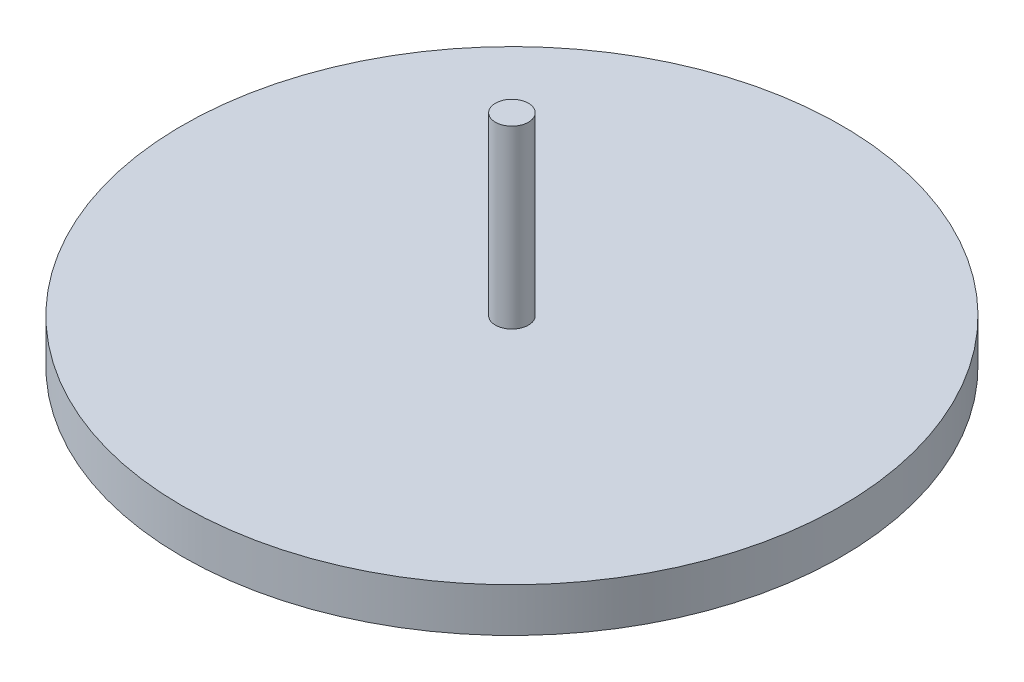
ISO-10303-21;
HEADER;
FILE_DESCRIPTION(('STEP AP214'),'2;1');
FILE_NAME('part.step','',(''),(''),'','','');
FILE_SCHEMA(('AUTOMOTIVE_DESIGN { 1 0 10303 214 1 1 1 1 }'));
ENDSEC;
DATA;
#1=APPLICATION_CONTEXT('core data for automotive mechanical design processes');
#2=APPLICATION_PROTOCOL_DEFINITION('international standard','automotive_design',2000,#1);
#3=PRODUCT_CONTEXT('',#1,'mechanical');
#4=PRODUCT('Part','Part','',(#3));
#5=PRODUCT_RELATED_PRODUCT_CATEGORY('part','',(#4));
#6=PRODUCT_DEFINITION_FORMATION('','',#4);
#7=PRODUCT_DEFINITION_CONTEXT('part definition',#1,'design');
#8=PRODUCT_DEFINITION('design','',#6,#7);
#9=PRODUCT_DEFINITION_SHAPE('','',#8);
#10=(LENGTH_UNIT() NAMED_UNIT(*) SI_UNIT(.MILLI.,.METRE.));
#11=(NAMED_UNIT(*) PLANE_ANGLE_UNIT() SI_UNIT($,.RADIAN.));
#12=(NAMED_UNIT(*) SI_UNIT($,.STERADIAN.) SOLID_ANGLE_UNIT());
#13=UNCERTAINTY_MEASURE_WITH_UNIT(LENGTH_MEASURE(1.E-05),#10,'distance_accuracy_value','');
#14=(GEOMETRIC_REPRESENTATION_CONTEXT(3) GLOBAL_UNCERTAINTY_ASSIGNED_CONTEXT((#13)) GLOBAL_UNIT_ASSIGNED_CONTEXT((#10,
#11,#12)) REPRESENTATION_CONTEXT('',''));
#15=CARTESIAN_POINT('',(0.,0.,0.));
#16=DIRECTION('',(0.,0.,1.));
#17=DIRECTION('',(1.,0.,0.));
#18=AXIS2_PLACEMENT_3D('',#15,#16,#17);
#19=CARTESIAN_POINT('',(0.,100.,0.));
#20=DIRECTION('',(0.,-1.,0.));
#21=DIRECTION('',(0.,0.,-1.));
#22=AXIS2_PLACEMENT_3D('',#19,#20,#21);
#23=CYLINDRICAL_SURFACE('',#22,7.5);
#24=CARTESIAN_POINT('',(0.,100.,0.));
#25=DIRECTION('',(0.,1.,0.));
#26=DIRECTION('',(0.,0.,1.));
#27=AXIS2_PLACEMENT_3D('',#24,#25,#26);
#28=CIRCLE('',#27,7.5);
#29=CARTESIAN_POINT('',(0.,100.,7.5));
#30=VERTEX_POINT('',#29);
#31=EDGE_CURVE('E11',#30,#30,#28,.T.);
#32=ORIENTED_EDGE('',*,*,#31,.F.);
#33=EDGE_LOOP('',(#32));
#34=FACE_BOUND('',#33,.T.);
#35=CARTESIAN_POINT('',(0.,20.,0.));
#36=DIRECTION('',(0.,1.,0.));
#37=DIRECTION('',(0.,0.,1.));
#38=AXIS2_PLACEMENT_3D('',#35,#36,#37);
#39=CIRCLE('',#38,7.5);
#40=CARTESIAN_POINT('',(0.,20.,7.5));
#41=VERTEX_POINT('',#40);
#42=EDGE_CURVE('E42',#41,#41,#39,.T.);
#43=ORIENTED_EDGE('',*,*,#42,.T.);
#44=EDGE_LOOP('',(#43));
#45=FACE_BOUND('',#44,.T.);
#46=ADVANCED_FACE('F39',(#34,#45),#23,.T.);
#47=CARTESIAN_POINT('',(0.,100.,0.));
#48=DIRECTION('',(0.,1.,0.));
#49=DIRECTION('',(0.,0.,1.));
#50=AXIS2_PLACEMENT_3D('',#47,#48,#49);
#51=PLANE('',#50);
#52=ORIENTED_EDGE('',*,*,#31,.T.);
#53=EDGE_LOOP('',(#52));
#54=FACE_BOUND('',#53,.T.);
#55=ADVANCED_FACE('F54',(#54),#51,.T.);
#56=CARTESIAN_POINT('',(0.,20.,0.));
#57=DIRECTION('',(0.,1.,0.));
#58=DIRECTION('',(0.,0.,1.));
#59=AXIS2_PLACEMENT_3D('',#56,#57,#58);
#60=PLANE('',#59);
#61=ORIENTED_EDGE('',*,*,#42,.F.);
#62=EDGE_LOOP('',(#61));
#63=FACE_BOUND('',#62,.T.);
#64=ADVANCED_FACE('F52',(#63),#60,.F.);
#65=CLOSED_SHELL('',(#46,#55,#64));
#66=MANIFOLD_SOLID_BREP('B2',#65);
#67=CARTESIAN_POINT('',(0.,20.,0.));
#68=DIRECTION('',(0.,-1.,0.));
#69=DIRECTION('',(0.,0.,-1.));
#70=AXIS2_PLACEMENT_3D('',#67,#68,#69);
#71=CYLINDRICAL_SURFACE('',#70,150.);
#72=CARTESIAN_POINT('',(0.,20.,0.));
#73=DIRECTION('',(0.,1.,0.));
#74=DIRECTION('',(0.,0.,1.));
#75=AXIS2_PLACEMENT_3D('',#72,#73,#74);
#76=CIRCLE('',#75,150.);
#77=CARTESIAN_POINT('',(0.,20.,150.));
#78=VERTEX_POINT('',#77);
#79=EDGE_CURVE('E38',#78,#78,#76,.T.);
#80=ORIENTED_EDGE('',*,*,#79,.F.);
#81=EDGE_LOOP('',(#80));
#82=FACE_BOUND('',#81,.T.);
#83=CARTESIAN_POINT('',(0.,0.,0.));
#84=DIRECTION('',(0.,1.,0.));
#85=DIRECTION('',(0.,0.,1.));
#86=AXIS2_PLACEMENT_3D('',#83,#84,#85);
#87=CIRCLE('',#86,150.);
#88=CARTESIAN_POINT('',(0.,0.,150.));
#89=VERTEX_POINT('',#88);
#90=EDGE_CURVE('E83',#89,#89,#87,.T.);
#91=ORIENTED_EDGE('',*,*,#90,.T.);
#92=EDGE_LOOP('',(#91));
#93=FACE_BOUND('',#92,.T.);
#94=ADVANCED_FACE('F80',(#82,#93),#71,.T.);
#95=CARTESIAN_POINT('',(0.,20.,0.));
#96=DIRECTION('',(0.,1.,0.));
#97=DIRECTION('',(0.,0.,1.));
#98=AXIS2_PLACEMENT_3D('',#95,#96,#97);
#99=PLANE('',#98);
#100=ORIENTED_EDGE('',*,*,#79,.T.);
#101=EDGE_LOOP('',(#100));
#102=FACE_BOUND('',#101,.T.);
#103=ADVANCED_FACE('F95',(#102),#99,.T.);
#104=CARTESIAN_POINT('',(0.,0.,0.));
#105=DIRECTION('',(0.,1.,0.));
#106=DIRECTION('',(0.,0.,1.));
#107=AXIS2_PLACEMENT_3D('',#104,#105,#106);
#108=PLANE('',#107);
#109=ORIENTED_EDGE('',*,*,#90,.F.);
#110=EDGE_LOOP('',(#109));
#111=FACE_BOUND('',#110,.T.);
#112=ADVANCED_FACE('F93',(#111),#108,.F.);
#113=CLOSED_SHELL('',(#94,#103,#112));
#114=MANIFOLD_SOLID_BREP('B6',#113);
#115=ADVANCED_BREP_SHAPE_REPRESENTATION('',(#18,#66,#114),#14);
#116=SHAPE_DEFINITION_REPRESENTATION(#9,#115);
ENDSEC;
END-ISO-10303-21;
